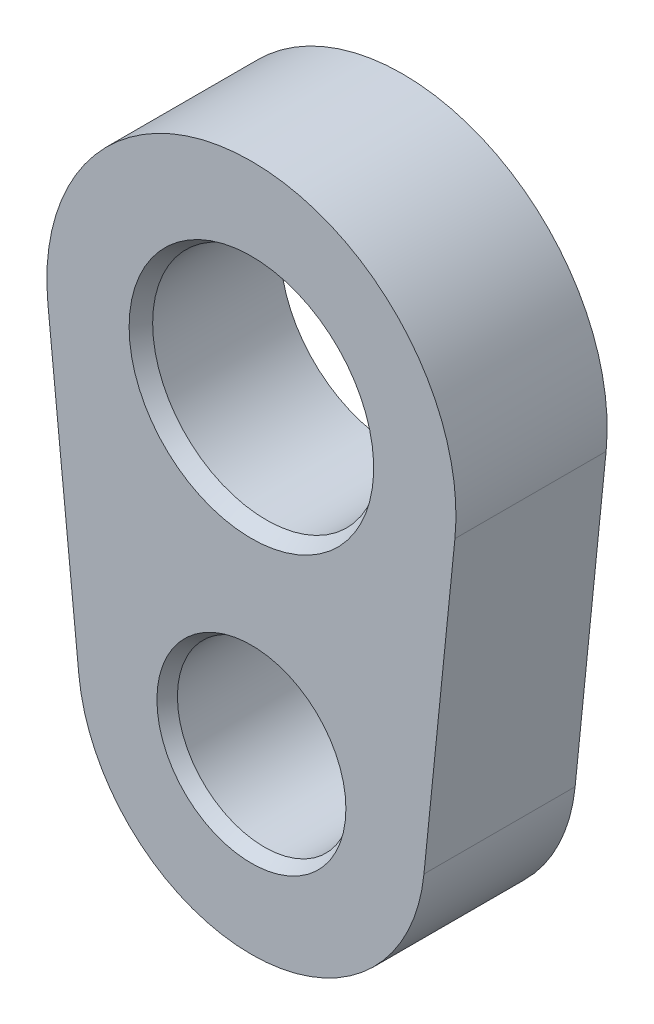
ISO-10303-21;
HEADER;
FILE_DESCRIPTION(('STEP AP214'),'2;1');
FILE_NAME('part.step','',(''),(''),'','','');
FILE_SCHEMA(('AUTOMOTIVE_DESIGN { 1 0 10303 214 1 1 1 1 }'));
ENDSEC;
DATA;
#1=APPLICATION_CONTEXT('core data for automotive mechanical design processes');
#2=APPLICATION_PROTOCOL_DEFINITION('international standard','automotive_design',2000,#1);
#3=PRODUCT_CONTEXT('',#1,'mechanical');
#4=PRODUCT('Part','Part','',(#3));
#5=PRODUCT_RELATED_PRODUCT_CATEGORY('part','',(#4));
#6=PRODUCT_DEFINITION_FORMATION('','',#4);
#7=PRODUCT_DEFINITION_CONTEXT('part definition',#1,'design');
#8=PRODUCT_DEFINITION('design','',#6,#7);
#9=PRODUCT_DEFINITION_SHAPE('','',#8);
#10=(LENGTH_UNIT() NAMED_UNIT(*) SI_UNIT(.MILLI.,.METRE.));
#11=(NAMED_UNIT(*) PLANE_ANGLE_UNIT() SI_UNIT($,.RADIAN.));
#12=(NAMED_UNIT(*) SI_UNIT($,.STERADIAN.) SOLID_ANGLE_UNIT());
#13=UNCERTAINTY_MEASURE_WITH_UNIT(LENGTH_MEASURE(1.E-05),#10,'distance_accuracy_value','');
#14=(GEOMETRIC_REPRESENTATION_CONTEXT(3) GLOBAL_UNCERTAINTY_ASSIGNED_CONTEXT((#13)) GLOBAL_UNIT_ASSIGNED_CONTEXT((#10,
#11,#12)) REPRESENTATION_CONTEXT('',''));
#15=CARTESIAN_POINT('',(0.,0.,0.));
#16=DIRECTION('',(0.,0.,1.));
#17=DIRECTION('',(1.,0.,0.));
#18=AXIS2_PLACEMENT_3D('',#15,#16,#17);
#19=CARTESIAN_POINT('',(0.,0.,3.4544));
#20=DIRECTION('',(0.,0.,-1.));
#21=DIRECTION('',(-1.,0.,0.));
#22=AXIS2_PLACEMENT_3D('',#19,#20,#21);
#23=PLANE('',#22);
#24=CARTESIAN_POINT('',(0.,0.,3.4544));
#25=DIRECTION('',(0.,0.,-1.));
#26=DIRECTION('',(-1.,0.,0.));
#27=AXIS2_PLACEMENT_3D('',#24,#25,#26);
#28=CIRCLE('',#27,2.159);
#29=CARTESIAN_POINT('',(-2.159,0.,3.4544));
#30=VERTEX_POINT('',#29);
#31=EDGE_CURVE('E11',#30,#30,#28,.T.);
#32=ORIENTED_EDGE('',*,*,#31,.T.);
#33=EDGE_LOOP('',(#32));
#34=FACE_BOUND('',#33,.T.);
#35=CARTESIAN_POINT('',(0.,7.0612,3.4544));
#36=DIRECTION('',(0.,0.,-1.));
#37=DIRECTION('',(-1.,0.,0.));
#38=AXIS2_PLACEMENT_3D('',#35,#36,#37);
#39=CIRCLE('',#38,2.794);
#40=CARTESIAN_POINT('',(-2.794,7.0612,3.4544));
#41=VERTEX_POINT('',#40);
#42=EDGE_CURVE('E119',#41,#41,#39,.T.);
#43=ORIENTED_EDGE('',*,*,#42,.T.);
#44=EDGE_LOOP('',(#43));
#45=FACE_BOUND('',#44,.T.);
#46=CARTESIAN_POINT('',(0.,0.,3.4544));
#47=DIRECTION('',(0.,0.,1.));
#48=DIRECTION('',(-1.,0.,0.));
#49=AXIS2_PLACEMENT_3D('',#46,#47,#48);
#50=CIRCLE('',#49,3.9624);
#51=CARTESIAN_POINT('',(-3.94225067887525,-0.399090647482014,3.4544));
#52=VERTEX_POINT('',#51);
#53=CARTESIAN_POINT('',(3.94225067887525,-0.399090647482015,3.4544));
#54=VERTEX_POINT('',#53);
#55=EDGE_CURVE('E86',#52,#54,#50,.T.);
#56=ORIENTED_EDGE('',*,*,#55,.T.);
#57=DIRECTION('',(0.100719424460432,0.994914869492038,0.));
#58=VECTOR('',#57,1.);
#59=CARTESIAN_POINT('',(4.64983413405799,6.59047769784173,3.4544));
#60=LINE('',#59,#58);
#61=CARTESIAN_POINT('',(4.64983413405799,6.59047769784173,3.4544));
#62=VERTEX_POINT('',#61);
#63=EDGE_CURVE('E82',#54,#62,#60,.T.);
#64=ORIENTED_EDGE('',*,*,#63,.T.);
#65=CARTESIAN_POINT('',(0.,7.0612,3.4544));
#66=DIRECTION('',(0.,0.,1.));
#67=DIRECTION('',(-1.,0.,0.));
#68=AXIS2_PLACEMENT_3D('',#65,#66,#67);
#69=CIRCLE('',#68,4.6736);
#70=CARTESIAN_POINT('',(-4.64983413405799,6.59047769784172,3.4544));
#71=VERTEX_POINT('',#70);
#72=EDGE_CURVE('E84',#62,#71,#69,.T.);
#73=ORIENTED_EDGE('',*,*,#72,.T.);
#74=DIRECTION('',(0.100719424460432,-0.994914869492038,0.));
#75=VECTOR('',#74,1.);
#76=CARTESIAN_POINT('',(-3.94225067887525,-0.399090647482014,3.4544));
#77=LINE('',#76,#75);
#78=EDGE_CURVE('E51',#71,#52,#77,.T.);
#79=ORIENTED_EDGE('',*,*,#78,.T.);
#80=EDGE_LOOP('',(#56,#64,#73,#79));
#81=FACE_BOUND('',#80,.T.);
#82=ADVANCED_FACE('F34',(#34,#45,#81),#23,.F.);
#83=CARTESIAN_POINT('',(0.,0.,0.));
#84=DIRECTION('',(0.,0.,-1.));
#85=DIRECTION('',(-1.,0.,0.));
#86=AXIS2_PLACEMENT_3D('',#83,#84,#85);
#87=PLANE('',#86);
#88=CARTESIAN_POINT('',(0.,0.,0.));
#89=DIRECTION('',(0.,0.,-1.));
#90=DIRECTION('',(-1.,0.,0.));
#91=AXIS2_PLACEMENT_3D('',#88,#89,#90);
#92=CIRCLE('',#91,2.28451011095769);
#93=CARTESIAN_POINT('',(-2.28451011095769,0.,0.));
#94=VERTEX_POINT('',#93);
#95=EDGE_CURVE('E122',#94,#94,#92,.F.);
#96=ORIENTED_EDGE('',*,*,#95,.T.);
#97=EDGE_LOOP('',(#96));
#98=FACE_BOUND('',#97,.T.);
#99=CARTESIAN_POINT('',(0.,7.0612,0.));
#100=DIRECTION('',(0.,0.,-1.));
#101=DIRECTION('',(-1.,0.,0.));
#102=AXIS2_PLACEMENT_3D('',#99,#100,#101);
#103=CIRCLE('',#102,2.93810420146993);
#104=CARTESIAN_POINT('',(-2.93810420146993,7.0612,0.));
#105=VERTEX_POINT('',#104);
#106=EDGE_CURVE('E110',#105,#105,#103,.F.);
#107=ORIENTED_EDGE('',*,*,#106,.T.);
#108=EDGE_LOOP('',(#107));
#109=FACE_BOUND('',#108,.T.);
#110=CARTESIAN_POINT('',(0.,0.,0.));
#111=DIRECTION('',(0.,0.,1.));
#112=DIRECTION('',(-1.,0.,0.));
#113=AXIS2_PLACEMENT_3D('',#110,#111,#112);
#114=CIRCLE('',#113,3.9624);
#115=CARTESIAN_POINT('',(-3.94225067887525,-0.399090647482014,0.));
#116=VERTEX_POINT('',#115);
#117=CARTESIAN_POINT('',(3.94225067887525,-0.399090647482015,0.));
#118=VERTEX_POINT('',#117);
#119=EDGE_CURVE('E101',#116,#118,#114,.T.);
#120=ORIENTED_EDGE('',*,*,#119,.F.);
#121=DIRECTION('',(0.100719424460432,-0.994914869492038,0.));
#122=VECTOR('',#121,1.);
#123=CARTESIAN_POINT('',(-3.94225067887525,-0.399090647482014,0.));
#124=LINE('',#123,#122);
#125=CARTESIAN_POINT('',(-4.64983413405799,6.59047769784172,0.));
#126=VERTEX_POINT('',#125);
#127=EDGE_CURVE('E74',#126,#116,#124,.T.);
#128=ORIENTED_EDGE('',*,*,#127,.F.);
#129=CARTESIAN_POINT('',(0.,7.0612,0.));
#130=DIRECTION('',(0.,0.,1.));
#131=DIRECTION('',(-1.,0.,0.));
#132=AXIS2_PLACEMENT_3D('',#129,#130,#131);
#133=CIRCLE('',#132,4.6736);
#134=CARTESIAN_POINT('',(4.64983413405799,6.59047769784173,0.));
#135=VERTEX_POINT('',#134);
#136=EDGE_CURVE('E68',#135,#126,#133,.T.);
#137=ORIENTED_EDGE('',*,*,#136,.F.);
#138=DIRECTION('',(0.100719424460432,0.994914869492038,0.));
#139=VECTOR('',#138,1.);
#140=CARTESIAN_POINT('',(4.64983413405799,6.59047769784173,0.));
#141=LINE('',#140,#139);
#142=EDGE_CURVE('E91',#118,#135,#141,.T.);
#143=ORIENTED_EDGE('',*,*,#142,.F.);
#144=EDGE_LOOP('',(#120,#128,#137,#143));
#145=FACE_BOUND('',#144,.T.);
#146=ADVANCED_FACE('F139',(#98,#109,#145),#87,.T.);
#147=CARTESIAN_POINT('',(0.,0.,3.4544));
#148=DIRECTION('',(0.,0.,-1.));
#149=DIRECTION('',(-1.,0.,0.));
#150=AXIS2_PLACEMENT_3D('',#147,#148,#149);
#151=CYLINDRICAL_SURFACE('',#150,3.9624);
#152=ORIENTED_EDGE('',*,*,#119,.T.);
#153=DIRECTION('',(0.,0.,-1.));
#154=VECTOR('',#153,1.);
#155=CARTESIAN_POINT('',(3.94225067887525,-0.399090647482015,3.4544));
#156=LINE('',#155,#154);
#157=EDGE_CURVE('E92',#54,#118,#156,.T.);
#158=ORIENTED_EDGE('',*,*,#157,.F.);
#159=ORIENTED_EDGE('',*,*,#55,.F.);
#160=DIRECTION('',(0.,0.,-1.));
#161=VECTOR('',#160,1.);
#162=CARTESIAN_POINT('',(-3.94225067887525,-0.399090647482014,3.4544));
#163=LINE('',#162,#161);
#164=EDGE_CURVE('E97',#52,#116,#163,.T.);
#165=ORIENTED_EDGE('',*,*,#164,.T.);
#166=EDGE_LOOP('',(#152,#158,#159,#165));
#167=FACE_BOUND('',#166,.T.);
#168=ADVANCED_FACE('F142',(#167),#151,.T.);
#169=CARTESIAN_POINT('',(4.64983413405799,6.59047769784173,3.4544));
#170=DIRECTION('',(-0.994914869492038,0.100719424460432,0.));
#171=DIRECTION('',(-0.100719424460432,-0.994914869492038,0.));
#172=AXIS2_PLACEMENT_3D('',#169,#170,#171);
#173=PLANE('',#172);
#174=ORIENTED_EDGE('',*,*,#142,.T.);
#175=DIRECTION('',(0.,0.,-1.));
#176=VECTOR('',#175,1.);
#177=CARTESIAN_POINT('',(4.64983413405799,6.59047769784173,3.4544));
#178=LINE('',#177,#176);
#179=EDGE_CURVE('E89',#62,#135,#178,.T.);
#180=ORIENTED_EDGE('',*,*,#179,.F.);
#181=ORIENTED_EDGE('',*,*,#63,.F.);
#182=ORIENTED_EDGE('',*,*,#157,.T.);
#183=EDGE_LOOP('',(#174,#180,#181,#182));
#184=FACE_BOUND('',#183,.T.);
#185=ADVANCED_FACE('F90',(#184),#173,.F.);
#186=CARTESIAN_POINT('',(0.,7.0612,3.4544));
#187=DIRECTION('',(0.,0.,-1.));
#188=DIRECTION('',(-1.,0.,0.));
#189=AXIS2_PLACEMENT_3D('',#186,#187,#188);
#190=CYLINDRICAL_SURFACE('',#189,4.6736);
#191=ORIENTED_EDGE('',*,*,#136,.T.);
#192=DIRECTION('',(0.,0.,-1.));
#193=VECTOR('',#192,1.);
#194=CARTESIAN_POINT('',(-4.64983413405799,6.59047769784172,3.4544));
#195=LINE('',#194,#193);
#196=EDGE_CURVE('E93',#71,#126,#195,.T.);
#197=ORIENTED_EDGE('',*,*,#196,.F.);
#198=ORIENTED_EDGE('',*,*,#72,.F.);
#199=ORIENTED_EDGE('',*,*,#179,.T.);
#200=EDGE_LOOP('',(#191,#197,#198,#199));
#201=FACE_BOUND('',#200,.T.);
#202=ADVANCED_FACE('F95',(#201),#190,.T.);
#203=CARTESIAN_POINT('',(-3.94225067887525,-0.399090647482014,3.4544));
#204=DIRECTION('',(0.994914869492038,0.100719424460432,0.));
#205=DIRECTION('',(-0.100719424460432,0.994914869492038,0.));
#206=AXIS2_PLACEMENT_3D('',#203,#204,#205);
#207=PLANE('',#206);
#208=ORIENTED_EDGE('',*,*,#127,.T.);
#209=ORIENTED_EDGE('',*,*,#164,.F.);
#210=ORIENTED_EDGE('',*,*,#78,.F.);
#211=ORIENTED_EDGE('',*,*,#196,.T.);
#212=EDGE_LOOP('',(#208,#209,#210,#211));
#213=FACE_BOUND('',#212,.T.);
#214=ADVANCED_FACE('F148',(#213),#207,.F.);
#215=CARTESIAN_POINT('',(0.,0.,3.4544));
#216=DIRECTION('',(0.,0.,-1.));
#217=DIRECTION('',(-1.,0.,0.));
#218=AXIS2_PLACEMENT_3D('',#215,#216,#217);
#219=CYLINDRICAL_SURFACE('',#218,1.98755);
#220=CARTESIAN_POINT('',(0.,0.,0.171450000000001));
#221=DIRECTION('',(0.,0.,-1.));
#222=DIRECTION('',(-1.,0.,0.));
#223=AXIS2_PLACEMENT_3D('',#220,#221,#222);
#224=CIRCLE('',#223,1.98755);
#225=CARTESIAN_POINT('',(-1.98755,0.,0.171450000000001));
#226=VERTEX_POINT('',#225);
#227=EDGE_CURVE('E43',#226,#226,#224,.T.);
#228=CARTESIAN_POINT('',(0.,0.,3.15743988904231));
#229=DIRECTION('',(0.,0.,-1.));
#230=DIRECTION('',(-1.,0.,0.));
#231=AXIS2_PLACEMENT_3D('',#228,#229,#230);
#232=CIRCLE('',#231,1.98755);
#233=CARTESIAN_POINT('',(-1.98755,0.,3.15743988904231));
#234=VERTEX_POINT('',#233);
#235=EDGE_CURVE('E125',#234,#234,#232,.F.);
#236=CARTESIAN_POINT('',(-1.98755,0.,0.171450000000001));
#237=CARTESIAN_POINT('',(-1.98755,0.,0.202554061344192));
#238=CARTESIAN_POINT('',(-1.98755,0.,0.233658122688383));
#239=CARTESIAN_POINT('',(-1.98755,0.,0.295866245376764));
#240=CARTESIAN_POINT('',(-1.98755,0.,0.326970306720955));
#241=CARTESIAN_POINT('',(-1.98755,0.,0.389178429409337));
#242=CARTESIAN_POINT('',(-1.98755,0.,0.420282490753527));
#243=CARTESIAN_POINT('',(-1.98755,0.,0.482490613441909));
#244=CARTESIAN_POINT('',(-1.98755,0.,0.513594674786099));
#245=CARTESIAN_POINT('',(-1.98755,0.,0.575802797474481));
#246=CARTESIAN_POINT('',(-1.98755,0.,0.606906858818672));
#247=CARTESIAN_POINT('',(-1.98755,0.,0.669114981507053));
#248=CARTESIAN_POINT('',(-1.98755,0.,0.700219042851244));
#249=CARTESIAN_POINT('',(-1.98755,0.,0.762427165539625));
#250=CARTESIAN_POINT('',(-1.98755,0.,0.793531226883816));
#251=CARTESIAN_POINT('',(-1.98755,0.,0.855739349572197));
#252=CARTESIAN_POINT('',(-1.98755,0.,0.886843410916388));
#253=CARTESIAN_POINT('',(-1.98755,0.,0.94905153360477));
#254=CARTESIAN_POINT('',(-1.98755,0.,0.98015559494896));
#255=CARTESIAN_POINT('',(-1.98755,0.,1.04236371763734));
#256=CARTESIAN_POINT('',(-1.98755,0.,1.07346777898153));
#257=CARTESIAN_POINT('',(-1.98755,0.,1.13567590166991));
#258=CARTESIAN_POINT('',(-1.98755,0.,1.16677996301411));
#259=CARTESIAN_POINT('',(-1.98755,0.,1.22898808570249));
#260=CARTESIAN_POINT('',(-1.98755,0.,1.26009214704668));
#261=CARTESIAN_POINT('',(-1.98755,0.,1.32230026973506));
#262=CARTESIAN_POINT('',(-1.98755,0.,1.35340433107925));
#263=CARTESIAN_POINT('',(-1.98755,0.,1.41561245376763));
#264=CARTESIAN_POINT('',(-1.98755,0.,1.44671651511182));
#265=CARTESIAN_POINT('',(-1.98755,0.,1.5089246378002));
#266=CARTESIAN_POINT('',(-1.98755,0.,1.54002869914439));
#267=CARTESIAN_POINT('',(-1.98755,0.,1.60223682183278));
#268=CARTESIAN_POINT('',(-1.98755,0.,1.63334088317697));
#269=CARTESIAN_POINT('',(-1.98755,0.,1.69554900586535));
#270=CARTESIAN_POINT('',(-1.98755,0.,1.72665306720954));
#271=CARTESIAN_POINT('',(-1.98755,0.,1.78886118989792));
#272=CARTESIAN_POINT('',(-1.98755,0.,1.81996525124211));
#273=CARTESIAN_POINT('',(-1.98755,0.,1.88217337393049));
#274=CARTESIAN_POINT('',(-1.98755,0.,1.91327743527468));
#275=CARTESIAN_POINT('',(-1.98755,0.,1.97548555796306));
#276=CARTESIAN_POINT('',(-1.98755,0.,2.00658961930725));
#277=CARTESIAN_POINT('',(-1.98755,0.,2.06879774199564));
#278=CARTESIAN_POINT('',(-1.98755,0.,2.09990180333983));
#279=CARTESIAN_POINT('',(-1.98755,0.,2.16210992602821));
#280=CARTESIAN_POINT('',(-1.98755,0.,2.1932139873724));
#281=CARTESIAN_POINT('',(-1.98755,0.,2.25542211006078));
#282=CARTESIAN_POINT('',(-1.98755,0.,2.28652617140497));
#283=CARTESIAN_POINT('',(-1.98755,0.,2.34873429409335));
#284=CARTESIAN_POINT('',(-1.98755,0.,2.37983835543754));
#285=CARTESIAN_POINT('',(-1.98755,0.,2.44204647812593));
#286=CARTESIAN_POINT('',(-1.98755,0.,2.47315053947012));
#287=CARTESIAN_POINT('',(-1.98755,0.,2.5353586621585));
#288=CARTESIAN_POINT('',(-1.98755,0.,2.56646272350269));
#289=CARTESIAN_POINT('',(-1.98755,0.,2.62867084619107));
#290=CARTESIAN_POINT('',(-1.98755,0.,2.65977490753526));
#291=CARTESIAN_POINT('',(-1.98755,0.,2.72198303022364));
#292=CARTESIAN_POINT('',(-1.98755,0.,2.75308709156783));
#293=CARTESIAN_POINT('',(-1.98755,0.,2.81529521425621));
#294=CARTESIAN_POINT('',(-1.98755,0.,2.8463992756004));
#295=CARTESIAN_POINT('',(-1.98755,0.,2.90860739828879));
#296=CARTESIAN_POINT('',(-1.98755,0.,2.93971145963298));
#297=CARTESIAN_POINT('',(-1.98755,0.,3.00191958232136));
#298=CARTESIAN_POINT('',(-1.98755,0.,3.03302364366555));
#299=CARTESIAN_POINT('',(-1.98755,0.,3.09523176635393));
#300=CARTESIAN_POINT('',(-1.98755,0.,3.12633582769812));
#301=CARTESIAN_POINT('',(-1.98755,0.,3.15743988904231));
#302=B_SPLINE_CURVE_WITH_KNOTS('',3,(#236,#237,#238,#239,#240,#241,#242,#243,#244,#245,#246,
#247,#248,#249,#250,#251,#252,#253,#254,#255,#256,#257,#258,#259,#260,#261,#262,#263,#264,#265,
#266,#267,#268,#269,#270,#271,#272,#273,#274,#275,#276,#277,#278,#279,#280,#281,#282,#283,#284,
#285,#286,#287,#288,#289,#290,#291,#292,#293,#294,#295,#296,#297,#298,#299,#300,#301),
.UNSPECIFIED.,.F.,.F.,(4,2,2,2,2,2,2,2,2,2,2,2,2,2,2,2,2,2,2,2,2,2,2,2,2,2,2,2,2,2,2,2,4),(0.,
0.0933121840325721,0.186624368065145,0.279936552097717,0.373248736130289,0.466560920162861,
0.559873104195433,0.653185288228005,0.746497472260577,0.83980965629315,0.933121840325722,
1.02643402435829,1.11974620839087,1.21305839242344,1.30637057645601,1.39968276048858,
1.49299494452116,1.58630712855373,1.6796193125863,1.77293149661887,1.86624368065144,
1.95955586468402,2.05286804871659,2.14618023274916,2.23949241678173,2.33280460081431,
2.42611678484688,2.51942896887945,2.61274115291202,2.70605333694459,2.79936552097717,
2.89267770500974,2.98598988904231),.UNSPECIFIED.);
#303=EDGE_CURVE('BSEAM130',#226,#234,#302,.T.);
#304=ORIENTED_EDGE('',*,*,#227,.T.);
#305=ORIENTED_EDGE('',*,*,#235,.T.);
#306=ORIENTED_EDGE('',*,*,#303,.T.);
#307=ORIENTED_EDGE('',*,*,#303,.F.);
#308=EDGE_LOOP('',(#304,#306,#305,#307));
#309=FACE_BOUND('',#308,.T.);
#310=ADVANCED_FACE('F130',(#309),#219,.F.);
#311=CARTESIAN_POINT('',(0.,7.0612,3.4544));
#312=DIRECTION('',(0.,0.,-1.));
#313=DIRECTION('',(-1.,0.,0.));
#314=AXIS2_PLACEMENT_3D('',#311,#312,#313);
#315=CYLINDRICAL_SURFACE('',#314,2.59715);
#316=CARTESIAN_POINT('',(0.,7.0612,0.19685));
#317=DIRECTION('',(0.,0.,-1.));
#318=DIRECTION('',(-1.,0.,0.));
#319=AXIS2_PLACEMENT_3D('',#316,#317,#318);
#320=CIRCLE('',#319,2.59715);
#321=CARTESIAN_POINT('',(-2.59715,7.0612,0.19685));
#322=VERTEX_POINT('',#321);
#323=EDGE_CURVE('E116',#322,#322,#320,.T.);
#324=ORIENTED_EDGE('',*,*,#323,.T.);
#325=EDGE_LOOP('',(#324));
#326=FACE_BOUND('',#325,.T.);
#327=CARTESIAN_POINT('',(0.,7.0612,3.11344579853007));
#328=DIRECTION('',(0.,0.,-1.));
#329=DIRECTION('',(-1.,0.,0.));
#330=AXIS2_PLACEMENT_3D('',#327,#328,#329);
#331=CIRCLE('',#330,2.59715);
#332=CARTESIAN_POINT('',(-2.59715,7.0612,3.11344579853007));
#333=VERTEX_POINT('',#332);
#334=EDGE_CURVE('E113',#333,#333,#331,.F.);
#335=ORIENTED_EDGE('',*,*,#334,.T.);
#336=EDGE_LOOP('',(#335));
#337=FACE_BOUND('',#336,.T.);
#338=ADVANCED_FACE('F155',(#326,#337),#315,.F.);
#339=CARTESIAN_POINT('',(0.,7.0612,0.));
#340=DIRECTION('',(0.,0.,-1.));
#341=DIRECTION('',(-1.,0.,0.));
#342=AXIS2_PLACEMENT_3D('',#339,#340,#341);
#343=CONICAL_SURFACE('',#342,2.93810420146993,1.0471975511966);
#344=CARTESIAN_POINT('',(-2.59715,7.0612,0.19685));
#345=CARTESIAN_POINT('',(-2.60070160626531,7.0612,0.194799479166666));
#346=CARTESIAN_POINT('',(-2.60425321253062,7.0612,0.192748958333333));
#347=CARTESIAN_POINT('',(-2.61135642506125,7.0612,0.188647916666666));
#348=CARTESIAN_POINT('',(-2.61490803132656,7.0612,0.186597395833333));
#349=CARTESIAN_POINT('',(-2.62201124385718,7.0612,0.182496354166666));
#350=CARTESIAN_POINT('',(-2.62556285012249,7.0612,0.180445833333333));
#351=CARTESIAN_POINT('',(-2.63266606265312,7.0612,0.176344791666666));
#352=CARTESIAN_POINT('',(-2.63621766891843,7.0612,0.174294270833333));
#353=CARTESIAN_POINT('',(-2.64332088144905,7.0612,0.170193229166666));
#354=CARTESIAN_POINT('',(-2.64687248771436,7.0612,0.168142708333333));
#355=CARTESIAN_POINT('',(-2.65397570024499,7.0612,0.164041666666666));
#356=CARTESIAN_POINT('',(-2.6575273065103,7.0612,0.161991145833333));
#357=CARTESIAN_POINT('',(-2.66463051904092,7.0612,0.157890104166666));
#358=CARTESIAN_POINT('',(-2.66818212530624,7.0612,0.155839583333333));
#359=CARTESIAN_POINT('',(-2.67528533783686,7.0612,0.151738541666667));
#360=CARTESIAN_POINT('',(-2.67883694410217,7.0612,0.149688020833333));
#361=CARTESIAN_POINT('',(-2.68594015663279,7.0612,0.145586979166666));
#362=CARTESIAN_POINT('',(-2.68949176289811,7.0612,0.143536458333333));
#363=CARTESIAN_POINT('',(-2.69659497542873,7.0612,0.139435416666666));
#364=CARTESIAN_POINT('',(-2.70014658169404,7.0612,0.137384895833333));
#365=CARTESIAN_POINT('',(-2.70724979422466,7.0612,0.133283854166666));
#366=CARTESIAN_POINT('',(-2.71080140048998,7.0612,0.131233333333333));
#367=CARTESIAN_POINT('',(-2.7179046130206,7.0612,0.127132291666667));
#368=CARTESIAN_POINT('',(-2.72145621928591,7.0612,0.125081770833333));
#369=CARTESIAN_POINT('',(-2.72855943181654,7.0612,0.120980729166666));
#370=CARTESIAN_POINT('',(-2.73211103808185,7.0612,0.118930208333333));
#371=CARTESIAN_POINT('',(-2.73921425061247,7.0612,0.114829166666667));
#372=CARTESIAN_POINT('',(-2.74276585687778,7.0612,0.112778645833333));
#373=CARTESIAN_POINT('',(-2.74986906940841,7.0612,0.108677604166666));
#374=CARTESIAN_POINT('',(-2.75342067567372,7.0612,0.106627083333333));
#375=CARTESIAN_POINT('',(-2.76052388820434,7.0612,0.102526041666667));
#376=CARTESIAN_POINT('',(-2.76407549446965,7.0612,0.100475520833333));
#377=CARTESIAN_POINT('',(-2.77117870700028,7.0612,0.0963744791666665));
#378=CARTESIAN_POINT('',(-2.77473031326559,7.0612,0.0943239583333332));
#379=CARTESIAN_POINT('',(-2.78183352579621,7.0612,0.0902229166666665));
#380=CARTESIAN_POINT('',(-2.78538513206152,7.0612,0.0881723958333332));
#381=CARTESIAN_POINT('',(-2.79248834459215,7.0612,0.0840713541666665));
#382=CARTESIAN_POINT('',(-2.79603995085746,7.0612,0.0820208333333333));
#383=CARTESIAN_POINT('',(-2.80314316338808,7.0612,0.0779197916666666));
#384=CARTESIAN_POINT('',(-2.8066947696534,7.0612,0.0758692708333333));
#385=CARTESIAN_POINT('',(-2.81379798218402,7.0612,0.0717682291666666));
#386=CARTESIAN_POINT('',(-2.81734958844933,7.0612,0.0697177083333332));
#387=CARTESIAN_POINT('',(-2.82445280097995,7.0612,0.0656166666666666));
#388=CARTESIAN_POINT('',(-2.82800440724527,7.0612,0.0635661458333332));
#389=CARTESIAN_POINT('',(-2.83510761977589,7.0612,0.0594651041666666));
#390=CARTESIAN_POINT('',(-2.8386592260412,7.0612,0.0574145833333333));
#391=CARTESIAN_POINT('',(-2.84576243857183,7.0612,0.0533135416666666));
#392=CARTESIAN_POINT('',(-2.84931404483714,7.0612,0.0512630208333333));
#393=CARTESIAN_POINT('',(-2.85641725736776,7.0612,0.0471619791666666));
#394=CARTESIAN_POINT('',(-2.85996886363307,7.0612,0.0451114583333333));
#395=CARTESIAN_POINT('',(-2.8670720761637,7.0612,0.0410104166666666));
#396=CARTESIAN_POINT('',(-2.87062368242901,7.0612,0.0389598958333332));
#397=CARTESIAN_POINT('',(-2.87772689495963,7.0612,0.0348588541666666));
#398=CARTESIAN_POINT('',(-2.88127850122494,7.0612,0.0328083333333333));
#399=CARTESIAN_POINT('',(-2.88838171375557,7.0612,0.0287072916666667));
#400=CARTESIAN_POINT('',(-2.89193332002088,7.0612,0.0266567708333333));
#401=CARTESIAN_POINT('',(-2.8990365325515,7.0612,0.0225557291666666));
#402=CARTESIAN_POINT('',(-2.90258813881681,7.0612,0.0205052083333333));
#403=CARTESIAN_POINT('',(-2.90969135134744,7.0612,0.0164041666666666));
#404=CARTESIAN_POINT('',(-2.91324295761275,7.0612,0.0143536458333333));
#405=CARTESIAN_POINT('',(-2.92034617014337,7.0612,0.0102526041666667));
#406=CARTESIAN_POINT('',(-2.92389777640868,7.0612,0.00820208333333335));
#407=CARTESIAN_POINT('',(-2.93100098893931,7.0612,0.00410104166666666));
#408=CARTESIAN_POINT('',(-2.93455259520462,7.0612,0.00205052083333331));
#409=CARTESIAN_POINT('',(-2.93810420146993,7.0612,0.));
#410=B_SPLINE_CURVE_WITH_KNOTS('',3,(#344,#345,#346,#347,#348,#349,#350,#351,#352,#353,#354,
#355,#356,#357,#358,#359,#360,#361,#362,#363,#364,#365,#366,#367,#368,#369,#370,#371,#372,#373,
#374,#375,#376,#377,#378,#379,#380,#381,#382,#383,#384,#385,#386,#387,#388,#389,#390,#391,#392,
#393,#394,#395,#396,#397,#398,#399,#400,#401,#402,#403,#404,#405,#406,#407,#408,#409),
.UNSPECIFIED.,.F.,.F.,(4,2,2,2,2,2,2,2,2,2,2,2,2,2,2,2,2,2,2,2,2,2,2,2,2,2,2,2,2,2,2,2,4),(0.,
0.0123031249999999,0.0246062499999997,0.036909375,0.0492124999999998,0.0615156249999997,
0.0738187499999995,0.0861218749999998,0.0984249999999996,0.110728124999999,0.123031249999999,
0.135334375,0.147637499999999,0.159940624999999,0.172243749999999,0.184546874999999,
0.196849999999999,0.209153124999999,0.221456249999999,0.233759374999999,0.246062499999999,
0.258365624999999,0.270668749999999,0.282971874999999,0.295274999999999,0.307578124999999,
0.319881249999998,0.332184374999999,0.344487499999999,0.356790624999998,0.369093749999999,
0.381396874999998,0.393699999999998),.UNSPECIFIED.);
#411=EDGE_CURVE('BSEAM166',#322,#105,#410,.T.);
#412=ORIENTED_EDGE('',*,*,#323,.F.);
#413=ORIENTED_EDGE('',*,*,#106,.F.);
#414=ORIENTED_EDGE('',*,*,#411,.T.);
#415=ORIENTED_EDGE('',*,*,#411,.F.);
#416=EDGE_LOOP('',(#412,#414,#413,#415));
#417=FACE_BOUND('',#416,.T.);
#418=ADVANCED_FACE('F166',(#417),#343,.F.);
#419=CARTESIAN_POINT('',(0.,7.0612,3.11344579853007));
#420=DIRECTION('',(0.,0.,1.));
#421=DIRECTION('',(1.,0.,0.));
#422=AXIS2_PLACEMENT_3D('',#419,#420,#421);
#423=CONICAL_SURFACE('',#422,2.59715,0.523598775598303);
#424=ORIENTED_EDGE('',*,*,#42,.F.);
#425=EDGE_LOOP('',(#424));
#426=FACE_BOUND('',#425,.T.);
#427=ORIENTED_EDGE('',*,*,#334,.F.);
#428=EDGE_LOOP('',(#427));
#429=FACE_BOUND('',#428,.T.);
#430=ADVANCED_FACE('F136',(#426,#429),#423,.F.);
#431=CARTESIAN_POINT('',(0.,0.,0.));
#432=DIRECTION('',(0.,0.,-1.));
#433=DIRECTION('',(-1.,0.,0.));
#434=AXIS2_PLACEMENT_3D('',#431,#432,#433);
#435=CONICAL_SURFACE('',#434,2.28451011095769,1.0471975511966);
#436=CARTESIAN_POINT('',(-1.98755,0.,0.171450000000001));
#437=CARTESIAN_POINT('',(-1.99064333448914,0.,0.169664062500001));
#438=CARTESIAN_POINT('',(-1.99373666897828,0.,0.167878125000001));
#439=CARTESIAN_POINT('',(-1.99992333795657,0.,0.164306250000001));
#440=CARTESIAN_POINT('',(-2.00301667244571,0.,0.162520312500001));
#441=CARTESIAN_POINT('',(-2.009203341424,0.,0.158948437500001));
#442=CARTESIAN_POINT('',(-2.01229667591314,0.,0.157162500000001));
#443=CARTESIAN_POINT('',(-2.01848334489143,0.,0.153590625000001));
#444=CARTESIAN_POINT('',(-2.02157667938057,0.,0.151804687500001));
#445=CARTESIAN_POINT('',(-2.02776334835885,0.,0.148232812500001));
#446=CARTESIAN_POINT('',(-2.030856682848,0.,0.146446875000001));
#447=CARTESIAN_POINT('',(-2.03704335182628,0.,0.142875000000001));
#448=CARTESIAN_POINT('',(-2.04013668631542,0.,0.141089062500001));
#449=CARTESIAN_POINT('',(-2.04632335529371,0.,0.137517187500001));
#450=CARTESIAN_POINT('',(-2.04941668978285,0.,0.135731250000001));
#451=CARTESIAN_POINT('',(-2.05560335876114,0.,0.132159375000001));
#452=CARTESIAN_POINT('',(-2.05869669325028,0.,0.130373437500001));
#453=CARTESIAN_POINT('',(-2.06488336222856,0.,0.126801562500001));
#454=CARTESIAN_POINT('',(-2.06797669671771,0.,0.125015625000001));
#455=CARTESIAN_POINT('',(-2.07416336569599,0.,0.121443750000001));
#456=CARTESIAN_POINT('',(-2.07725670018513,0.,0.119657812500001));
#457=CARTESIAN_POINT('',(-2.08344336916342,0.,0.116085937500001));
#458=CARTESIAN_POINT('',(-2.08653670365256,0.,0.114300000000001));
#459=CARTESIAN_POINT('',(-2.09272337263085,0.,0.110728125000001));
#460=CARTESIAN_POINT('',(-2.09581670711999,0.,0.108942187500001));
#461=CARTESIAN_POINT('',(-2.10200337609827,0.,0.105370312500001));
#462=CARTESIAN_POINT('',(-2.10509671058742,0.,0.103584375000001));
#463=CARTESIAN_POINT('',(-2.1112833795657,0.,0.100012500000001));
#464=CARTESIAN_POINT('',(-2.11437671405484,0.,0.0982265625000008));
#465=CARTESIAN_POINT('',(-2.12056338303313,0.,0.0946546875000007));
#466=CARTESIAN_POINT('',(-2.12365671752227,0.,0.0928687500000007));
#467=CARTESIAN_POINT('',(-2.12984338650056,0.,0.0892968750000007));
#468=CARTESIAN_POINT('',(-2.1329367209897,0.,0.0875109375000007));
#469=CARTESIAN_POINT('',(-2.13912338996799,0.,0.0839390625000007));
#470=CARTESIAN_POINT('',(-2.14221672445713,0.,0.0821531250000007));
#471=CARTESIAN_POINT('',(-2.14840339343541,0.,0.0785812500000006));
#472=CARTESIAN_POINT('',(-2.15149672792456,0.,0.0767953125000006));
#473=CARTESIAN_POINT('',(-2.15768339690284,0.,0.0732234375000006));
#474=CARTESIAN_POINT('',(-2.16077673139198,0.,0.0714375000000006));
#475=CARTESIAN_POINT('',(-2.16696340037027,0.,0.0678656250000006));
#476=CARTESIAN_POINT('',(-2.17005673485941,0.,0.0660796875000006));
#477=CARTESIAN_POINT('',(-2.1762434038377,0.,0.0625078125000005));
#478=CARTESIAN_POINT('',(-2.17933673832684,0.,0.0607218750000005));
#479=CARTESIAN_POINT('',(-2.18552340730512,0.,0.0571500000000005));
#480=CARTESIAN_POINT('',(-2.18861674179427,0.,0.0553640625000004));
#481=CARTESIAN_POINT('',(-2.19480341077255,0.,0.0517921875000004));
#482=CARTESIAN_POINT('',(-2.19789674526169,0.,0.0500062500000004));
#483=CARTESIAN_POINT('',(-2.20408341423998,0.,0.0464343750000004));
#484=CARTESIAN_POINT('',(-2.20717674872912,0.,0.0446484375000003));
#485=CARTESIAN_POINT('',(-2.21336341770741,0.,0.0410765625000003));
#486=CARTESIAN_POINT('',(-2.21645675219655,0.,0.0392906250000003));
#487=CARTESIAN_POINT('',(-2.22264342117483,0.,0.0357187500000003));
#488=CARTESIAN_POINT('',(-2.22573675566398,0.,0.0339328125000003));
#489=CARTESIAN_POINT('',(-2.23192342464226,0.,0.0303609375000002));
#490=CARTESIAN_POINT('',(-2.2350167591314,0.,0.0285750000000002));
#491=CARTESIAN_POINT('',(-2.24120342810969,0.,0.0250031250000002));
#492=CARTESIAN_POINT('',(-2.24429676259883,0.,0.0232171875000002));
#493=CARTESIAN_POINT('',(-2.25048343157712,0.,0.0196453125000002));
#494=CARTESIAN_POINT('',(-2.25357676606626,0.,0.0178593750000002));
#495=CARTESIAN_POINT('',(-2.25976343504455,0.,0.0142875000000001));
#496=CARTESIAN_POINT('',(-2.26285676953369,0.,0.0125015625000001));
#497=CARTESIAN_POINT('',(-2.26904343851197,0.,0.00892968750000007));
#498=CARTESIAN_POINT('',(-2.27213677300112,0.,0.00714375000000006));
#499=CARTESIAN_POINT('',(-2.2783234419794,0.,0.00357187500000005));
#500=CARTESIAN_POINT('',(-2.28141677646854,0.,0.00178593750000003));
#501=CARTESIAN_POINT('',(-2.28451011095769,0.,0.));
#502=B_SPLINE_CURVE_WITH_KNOTS('',3,(#436,#437,#438,#439,#440,#441,#442,#443,#444,#445,#446,
#447,#448,#449,#450,#451,#452,#453,#454,#455,#456,#457,#458,#459,#460,#461,#462,#463,#464,#465,
#466,#467,#468,#469,#470,#471,#472,#473,#474,#475,#476,#477,#478,#479,#480,#481,#482,#483,#484,
#485,#486,#487,#488,#489,#490,#491,#492,#493,#494,#495,#496,#497,#498,#499,#500,#501),
.UNSPECIFIED.,.F.,.F.,(4,2,2,2,2,2,2,2,2,2,2,2,2,2,2,2,2,2,2,2,2,2,2,2,2,2,2,2,2,2,2,2,4),(0.,
0.0107156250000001,0.0214312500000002,0.0321468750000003,0.0428625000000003,0.0535781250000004,
0.0642937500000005,0.0750093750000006,0.0857250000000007,0.0964406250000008,0.107156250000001,
0.117871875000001,0.128587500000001,0.139303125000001,0.150018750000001,0.160734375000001,
0.171450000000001,0.182165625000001,0.192881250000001,0.203596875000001,0.214312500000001,
0.225028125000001,0.235743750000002,0.246459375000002,0.257175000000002,0.267890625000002,
0.278606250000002,0.289321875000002,0.300037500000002,0.310753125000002,0.321468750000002,
0.332184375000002,0.342900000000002),.UNSPECIFIED.);
#503=EDGE_CURVE('BSEAM133',#226,#94,#502,.T.);
#504=ORIENTED_EDGE('',*,*,#227,.F.);
#505=ORIENTED_EDGE('',*,*,#95,.F.);
#506=ORIENTED_EDGE('',*,*,#503,.T.);
#507=ORIENTED_EDGE('',*,*,#503,.F.);
#508=EDGE_LOOP('',(#504,#506,#505,#507));
#509=FACE_BOUND('',#508,.T.);
#510=ADVANCED_FACE('F133',(#509),#435,.F.);
#511=CARTESIAN_POINT('',(0.,0.,3.15743988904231));
#512=DIRECTION('',(0.,0.,1.));
#513=DIRECTION('',(1.,0.,0.));
#514=AXIS2_PLACEMENT_3D('',#511,#512,#513);
#515=CONICAL_SURFACE('',#514,1.98755,0.5235987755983);
#516=ORIENTED_EDGE('',*,*,#31,.F.);
#517=EDGE_LOOP('',(#516));
#518=FACE_BOUND('',#517,.T.);
#519=ORIENTED_EDGE('',*,*,#235,.F.);
#520=EDGE_LOOP('',(#519));
#521=FACE_BOUND('',#520,.T.);
#522=ADVANCED_FACE('F36',(#518,#521),#515,.F.);
#523=CLOSED_SHELL('',(#82,#146,#168,#185,#202,#214,#310,#338,#418,#430,#510,#522));
#524=MANIFOLD_SOLID_BREP('B2',#523);
#525=ADVANCED_BREP_SHAPE_REPRESENTATION('',(#18,#524),#14);
#526=SHAPE_DEFINITION_REPRESENTATION(#9,#525);
ENDSEC;
END-ISO-10303-21;
